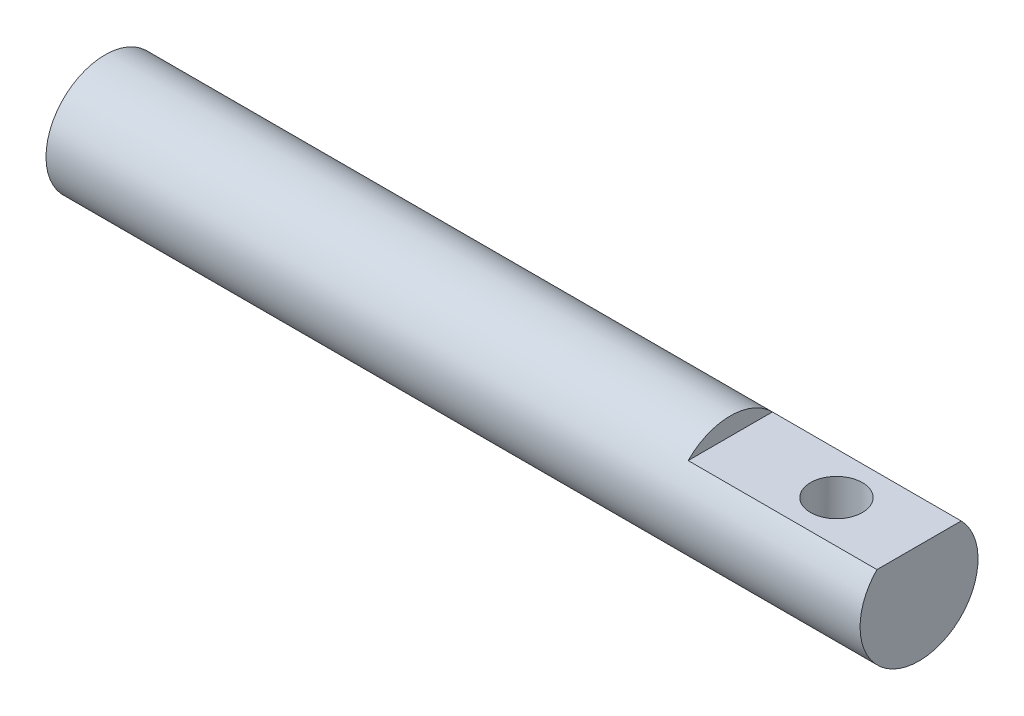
from build123d import *

# Parameters (mm, degrees)
CUT_EXTRUDE_1_DEPTH    = 32
M10X1_25_1_D           = 8.8
CUT_EXTRUDE_2_DEPTH    = 4
HOLE_WIZARD_M3_1_D     = 2.5
HOLE_WIZARD_M3_1_DEPTH = 8.5
HOLE_WIZARD_M3_1_TIP   = 0.751075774


with BuildPart() as part:
    # Sketch 1 → Revolve 1 (revolve)
    with BuildSketch(Plane.XY, mode=Mode.PRIVATE) as revolve_1_sk:
        Polygon((-69, 10), (69, 10), (69, 0), (-19, 0), (-19, 7), (-55, 7), (-55, 6), (-69, 6), align=None)
    revolve(revolve_1_sk.sketch.rotate(Axis((-90.466396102, 0, 0), (1, 0, 0)), 90), axis=Axis((-90.466396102, 0, 0), (1, 0, 0)))

    # Sketch 2 → Cut-Extrude 1 (cut)
    with BuildSketch(Plane(origin=(69, 0, 0), x_dir=(0, 0, -1), z_dir=(1, 0, 0))):
        with BuildLine():
            Line((-7.141428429, 7), (7.141428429, 7))
            ThreePointArc((7.141428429, 7), (0, 10), (-7.141428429, 7))
        make_face()
    extrude(amount=-CUT_EXTRUDE_1_DEPTH, mode=Mode.SUBTRACT)

    # M10x1.25 _1 (through all)
    with Locations(Plane(origin=(55, 7, 0), x_dir=(0, 0, 1), z_dir=(0, 1, 0))):
        with Locations((0, 0)):
            Hole(M10X1_25_1_D / 2)

    # Sketch 5 → Cut-Extrude 2 (cut)
    with BuildSketch(Plane(origin=(0, -10, 0), x_dir=(-1, 0, 0), z_dir=(0, 1, 0))):
        with BuildLine():
            Line((4, 4), (-4, 4))
            ThreePointArc((-4, 4), (-8, 0), (-4, -4))
            Line((-4, -4), (4, -4))
            ThreePointArc((4, -4), (8, 0), (4, 4))
        make_face()
    extrude(amount=CUT_EXTRUDE_2_DEPTH, mode=Mode.SUBTRACT)

    # Hole Wizard M3 _1
    with Locations(Plane(origin=(0, -6, 0), x_dir=(0, 0, -1), z_dir=(0, -1, 0))):
        with Locations((0, 0)):
            Hole(HOLE_WIZARD_M3_1_D / 2, depth=HOLE_WIZARD_M3_1_DEPTH)
            with Locations((0, 0, -(HOLE_WIZARD_M3_1_DEPTH + HOLE_WIZARD_M3_1_TIP / 2))):  # 118° drill point
                Cone(0, HOLE_WIZARD_M3_1_D / 2, HOLE_WIZARD_M3_1_TIP, mode=Mode.SUBTRACT)


solid = part.part
